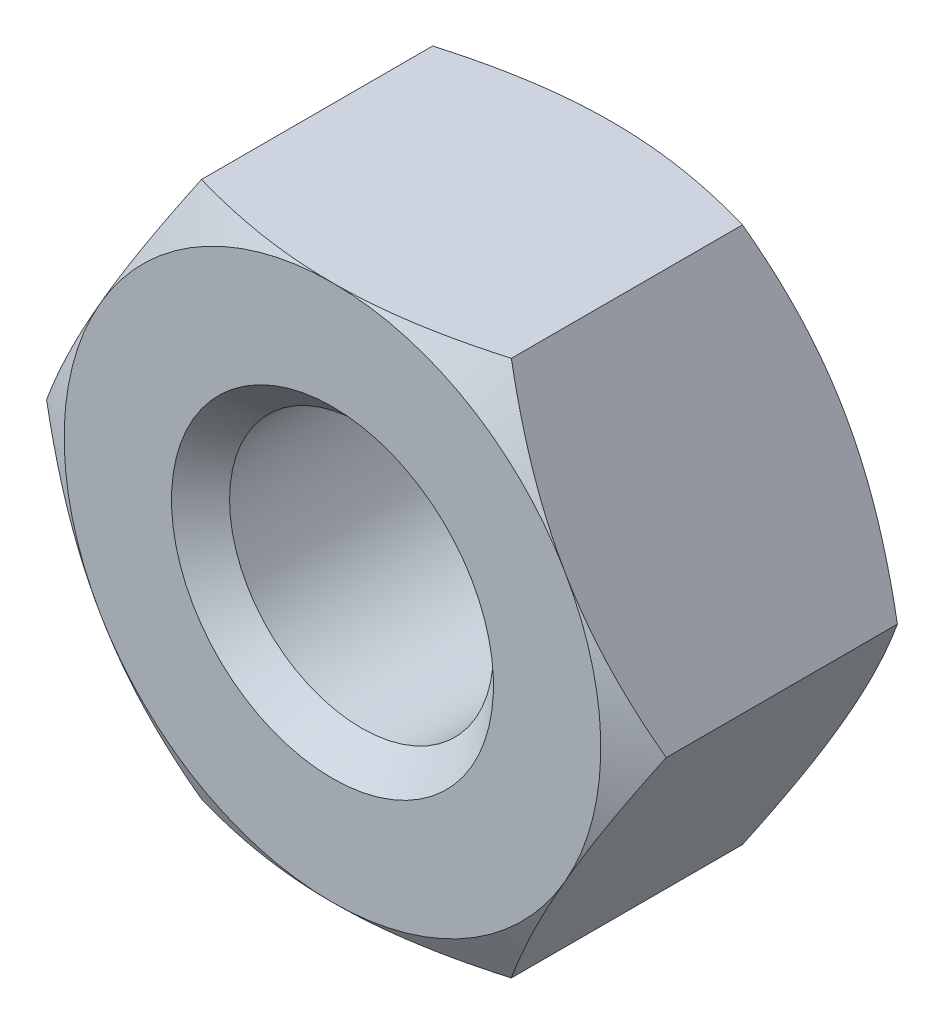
ISO-10303-21;
HEADER;
FILE_DESCRIPTION(('STEP AP214'),'2;1');
FILE_NAME('part.step','',(''),(''),'','','');
FILE_SCHEMA(('AUTOMOTIVE_DESIGN { 1 0 10303 214 1 1 1 1 }'));
ENDSEC;
DATA;
#1=APPLICATION_CONTEXT('core data for automotive mechanical design processes');
#2=APPLICATION_PROTOCOL_DEFINITION('international standard','automotive_design',2000,#1);
#3=PRODUCT_CONTEXT('',#1,'mechanical');
#4=PRODUCT('Part','Part','',(#3));
#5=PRODUCT_RELATED_PRODUCT_CATEGORY('part','',(#4));
#6=PRODUCT_DEFINITION_FORMATION('','',#4);
#7=PRODUCT_DEFINITION_CONTEXT('part definition',#1,'design');
#8=PRODUCT_DEFINITION('design','',#6,#7);
#9=PRODUCT_DEFINITION_SHAPE('','',#8);
#10=(LENGTH_UNIT() NAMED_UNIT(*) SI_UNIT(.MILLI.,.METRE.));
#11=(NAMED_UNIT(*) PLANE_ANGLE_UNIT() SI_UNIT($,.RADIAN.));
#12=(NAMED_UNIT(*) SI_UNIT($,.STERADIAN.) SOLID_ANGLE_UNIT());
#13=UNCERTAINTY_MEASURE_WITH_UNIT(LENGTH_MEASURE(1.E-05),#10,'distance_accuracy_value','');
#14=(GEOMETRIC_REPRESENTATION_CONTEXT(3) GLOBAL_UNCERTAINTY_ASSIGNED_CONTEXT((#13)) GLOBAL_UNIT_ASSIGNED_CONTEXT((#10,
#11,#12)) REPRESENTATION_CONTEXT('',''));
#15=CARTESIAN_POINT('',(0.,0.,0.));
#16=DIRECTION('',(0.,0.,1.));
#17=DIRECTION('',(1.,0.,0.));
#18=AXIS2_PLACEMENT_3D('',#15,#16,#17);
#19=CARTESIAN_POINT('',(4.3301270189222,2.5,-1.));
#20=DIRECTION('',(0.866025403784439,0.5,0.));
#21=DIRECTION('',(-0.5,0.866025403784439,0.));
#22=AXIS2_PLACEMENT_3D('',#19,#20,#21);
#23=PLANE('',#22);
#24=CARTESIAN_POINT('',(2.8852546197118,5.00259240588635,0.44744645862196));
#25=CARTESIAN_POINT('',(3.65965258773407,3.66129577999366,0.));
#26=CARTESIAN_POINT('',(4.3301270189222,2.5,0.));
#27=CARTESIAN_POINT('',(5.0006014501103,1.33870422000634,0.));
#28=CARTESIAN_POINT('',(5.77499941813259,-0.00259240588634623,0.447446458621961));
#29=(BOUNDED_CURVE() B_SPLINE_CURVE(2,(#24,#25,#26,#27,#28),.UNSPECIFIED.,.F.,
.F.) B_SPLINE_CURVE_WITH_KNOTS((3,2,3),(0.,2.9316581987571,5.8633163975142),
.UNSPECIFIED.) CURVE() GEOMETRIC_REPRESENTATION_ITEM() RATIONAL_B_SPLINE_CURVE((1.,
1.03802697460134,1.,1.03802697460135,1.)) REPRESENTATION_ITEM(''));
#30=CARTESIAN_POINT('',(2.88675134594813,5.,0.446581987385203));
#31=VERTEX_POINT('',#30);
#32=CARTESIAN_POINT('',(4.3301270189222,2.5,0.));
#33=VERTEX_POINT('',#32);
#34=EDGE_CURVE('E358',#31,#33,#29,.T.);
#35=ORIENTED_EDGE('',*,*,#34,.F.);
#36=DIRECTION('',(0.,0.,1.));
#37=VECTOR('',#36,1.);
#38=CARTESIAN_POINT('',(2.88675134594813,5.,-1.));
#39=LINE('',#38,#37);
#40=CARTESIAN_POINT('',(2.88675134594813,5.,4.7534180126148));
#41=VERTEX_POINT('',#40);
#42=EDGE_CURVE('E74',#31,#41,#39,.T.);
#43=ORIENTED_EDGE('',*,*,#42,.T.);
#44=CARTESIAN_POINT('',(5.77499941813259,-0.00259240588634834,4.75255354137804));
#45=CARTESIAN_POINT('',(5.00060145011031,1.33870422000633,5.19999999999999));
#46=CARTESIAN_POINT('',(4.3301270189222,2.5,5.2));
#47=CARTESIAN_POINT('',(3.65965258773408,3.66129577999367,5.2));
#48=CARTESIAN_POINT('',(2.88525461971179,5.00259240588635,4.75255354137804));
#49=(BOUNDED_CURVE() B_SPLINE_CURVE(2,(#44,#45,#46,#47,#48),.UNSPECIFIED.,.F.,
.F.) B_SPLINE_CURVE_WITH_KNOTS((3,2,3),(0.,2.9316581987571,5.86331639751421),
.UNSPECIFIED.) CURVE() GEOMETRIC_REPRESENTATION_ITEM() RATIONAL_B_SPLINE_CURVE((1.,
1.03802697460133,1.,1.03802697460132,1.)) REPRESENTATION_ITEM(''));
#50=CARTESIAN_POINT('',(4.3301270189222,2.5,5.2));
#51=VERTEX_POINT('',#50);
#52=EDGE_CURVE('E350',#51,#41,#49,.T.);
#53=ORIENTED_EDGE('',*,*,#52,.F.);
#54=CARTESIAN_POINT('',(5.77499941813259,-0.00259240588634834,4.75255354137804));
#55=CARTESIAN_POINT('',(5.00060145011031,1.33870422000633,5.19999999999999));
#56=CARTESIAN_POINT('',(4.3301270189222,2.5,5.2));
#57=CARTESIAN_POINT('',(3.65965258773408,3.66129577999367,5.2));
#58=CARTESIAN_POINT('',(2.88525461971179,5.00259240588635,4.75255354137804));
#59=(BOUNDED_CURVE() B_SPLINE_CURVE(2,(#54,#55,#56,#57,#58),.UNSPECIFIED.,.F.,
.F.) B_SPLINE_CURVE_WITH_KNOTS((3,2,3),(0.,2.9316581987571,5.86331639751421),
.UNSPECIFIED.) CURVE() GEOMETRIC_REPRESENTATION_ITEM() RATIONAL_B_SPLINE_CURVE((1.,
1.03802697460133,1.,1.03802697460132,1.)) REPRESENTATION_ITEM(''));
#60=CARTESIAN_POINT('',(5.77350269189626,0.,4.7534180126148));
#61=VERTEX_POINT('',#60);
#62=EDGE_CURVE('E530',#61,#51,#59,.T.);
#63=ORIENTED_EDGE('',*,*,#62,.F.);
#64=DIRECTION('',(0.,0.,1.));
#65=VECTOR('',#64,1.);
#66=CARTESIAN_POINT('',(5.77350269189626,0.,-1.));
#67=LINE('',#66,#65);
#68=CARTESIAN_POINT('',(5.77350269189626,0.,0.446581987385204));
#69=VERTEX_POINT('',#68);
#70=EDGE_CURVE('E420',#69,#61,#67,.T.);
#71=ORIENTED_EDGE('',*,*,#70,.F.);
#72=CARTESIAN_POINT('',(2.8852546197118,5.00259240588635,0.44744645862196));
#73=CARTESIAN_POINT('',(3.65965258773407,3.66129577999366,0.));
#74=CARTESIAN_POINT('',(4.3301270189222,2.5,0.));
#75=CARTESIAN_POINT('',(5.0006014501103,1.33870422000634,0.));
#76=CARTESIAN_POINT('',(5.77499941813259,-0.00259240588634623,0.447446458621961));
#77=(BOUNDED_CURVE() B_SPLINE_CURVE(2,(#72,#73,#74,#75,#76),.UNSPECIFIED.,.F.,
.F.) B_SPLINE_CURVE_WITH_KNOTS((3,2,3),(0.,2.9316581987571,5.8633163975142),
.UNSPECIFIED.) CURVE() GEOMETRIC_REPRESENTATION_ITEM() RATIONAL_B_SPLINE_CURVE((1.,
1.03802697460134,1.,1.03802697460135,1.)) REPRESENTATION_ITEM(''));
#78=EDGE_CURVE('E447',#33,#69,#77,.T.);
#79=ORIENTED_EDGE('',*,*,#78,.F.);
#80=EDGE_LOOP('',(#35,#43,#53,#63,#71,#79));
#81=FACE_BOUND('',#80,.T.);
#82=ADVANCED_FACE('F56',(#81),#23,.T.);
#83=CARTESIAN_POINT('',(0.,5.,-1.));
#84=DIRECTION('',(0.,1.,0.));
#85=DIRECTION('',(-1.,0.,0.));
#86=AXIS2_PLACEMENT_3D('',#83,#84,#85);
#87=PLANE('',#86);
#88=CARTESIAN_POINT('',(-2.88974479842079,5.,0.44744645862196));
#89=CARTESIAN_POINT('',(-1.34094886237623,5.,0.));
#90=CARTESIAN_POINT('',(0.,5.,0.));
#91=CARTESIAN_POINT('',(1.34094886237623,5.,0.));
#92=CARTESIAN_POINT('',(2.88974479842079,5.,0.44744645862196));
#93=(BOUNDED_CURVE() B_SPLINE_CURVE(2,(#88,#89,#90,#91,#92),.UNSPECIFIED.,.F.,
.F.) B_SPLINE_CURVE_WITH_KNOTS((3,2,3),(0.,2.9316581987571,5.8633163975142),
.UNSPECIFIED.) CURVE() GEOMETRIC_REPRESENTATION_ITEM() RATIONAL_B_SPLINE_CURVE((1.,
1.03802697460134,1.,1.03802697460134,1.)) REPRESENTATION_ITEM(''));
#94=CARTESIAN_POINT('',(-2.88675134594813,5.,0.446581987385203));
#95=VERTEX_POINT('',#94);
#96=CARTESIAN_POINT('',(0.,5.,0.));
#97=VERTEX_POINT('',#96);
#98=EDGE_CURVE('E258',#95,#97,#93,.T.);
#99=ORIENTED_EDGE('',*,*,#98,.F.);
#100=DIRECTION('',(0.,0.,1.));
#101=VECTOR('',#100,1.);
#102=CARTESIAN_POINT('',(-2.88675134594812,5.,-1.));
#103=LINE('',#102,#101);
#104=CARTESIAN_POINT('',(-2.88675134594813,5.,4.7534180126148));
#105=VERTEX_POINT('',#104);
#106=EDGE_CURVE('E193',#95,#105,#103,.T.);
#107=ORIENTED_EDGE('',*,*,#106,.T.);
#108=CARTESIAN_POINT('',(2.88974479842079,5.,4.75255354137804));
#109=CARTESIAN_POINT('',(1.34094886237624,5.,5.2));
#110=CARTESIAN_POINT('',(0.,5.,5.2));
#111=CARTESIAN_POINT('',(-1.34094886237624,5.,5.2));
#112=CARTESIAN_POINT('',(-2.88974479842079,5.,4.75255354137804));
#113=(BOUNDED_CURVE() B_SPLINE_CURVE(2,(#108,#109,#110,#111,#112),.UNSPECIFIED.,.F.,
.F.) B_SPLINE_CURVE_WITH_KNOTS((3,2,3),(0.,2.9316581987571,5.8633163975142),
.UNSPECIFIED.) CURVE() GEOMETRIC_REPRESENTATION_ITEM() RATIONAL_B_SPLINE_CURVE((1.,
1.03802697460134,1.,1.03802697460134,1.)) REPRESENTATION_ITEM(''));
#114=CARTESIAN_POINT('',(0.,5.,5.2));
#115=VERTEX_POINT('',#114);
#116=EDGE_CURVE('E475',#115,#105,#113,.T.);
#117=ORIENTED_EDGE('',*,*,#116,.F.);
#118=CARTESIAN_POINT('',(2.88974479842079,5.,4.75255354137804));
#119=CARTESIAN_POINT('',(1.34094886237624,5.,5.2));
#120=CARTESIAN_POINT('',(0.,5.,5.2));
#121=CARTESIAN_POINT('',(-1.34094886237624,5.,5.2));
#122=CARTESIAN_POINT('',(-2.88974479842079,5.,4.75255354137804));
#123=(BOUNDED_CURVE() B_SPLINE_CURVE(2,(#118,#119,#120,#121,#122),.UNSPECIFIED.,.F.,
.F.) B_SPLINE_CURVE_WITH_KNOTS((3,2,3),(0.,2.9316581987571,5.8633163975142),
.UNSPECIFIED.) CURVE() GEOMETRIC_REPRESENTATION_ITEM() RATIONAL_B_SPLINE_CURVE((1.,
1.03802697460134,1.,1.03802697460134,1.)) REPRESENTATION_ITEM(''));
#124=EDGE_CURVE('E299',#41,#115,#123,.T.);
#125=ORIENTED_EDGE('',*,*,#124,.F.);
#126=ORIENTED_EDGE('',*,*,#42,.F.);
#127=CARTESIAN_POINT('',(-2.88974479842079,5.,0.44744645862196));
#128=CARTESIAN_POINT('',(-1.34094886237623,5.,0.));
#129=CARTESIAN_POINT('',(0.,5.,0.));
#130=CARTESIAN_POINT('',(1.34094886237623,5.,0.));
#131=CARTESIAN_POINT('',(2.88974479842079,5.,0.44744645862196));
#132=(BOUNDED_CURVE() B_SPLINE_CURVE(2,(#127,#128,#129,#130,#131),.UNSPECIFIED.,.F.,
.F.) B_SPLINE_CURVE_WITH_KNOTS((3,2,3),(0.,2.9316581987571,5.8633163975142),
.UNSPECIFIED.) CURVE() GEOMETRIC_REPRESENTATION_ITEM() RATIONAL_B_SPLINE_CURVE((1.,
1.03802697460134,1.,1.03802697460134,1.)) REPRESENTATION_ITEM(''));
#133=EDGE_CURVE('E221',#97,#31,#132,.T.);
#134=ORIENTED_EDGE('',*,*,#133,.F.);
#135=EDGE_LOOP('',(#99,#107,#117,#125,#126,#134));
#136=FACE_BOUND('',#135,.T.);
#137=ADVANCED_FACE('F619',(#136),#87,.T.);
#138=CARTESIAN_POINT('',(-4.3301270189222,2.5,-1.));
#139=DIRECTION('',(-0.866025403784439,0.5,0.));
#140=DIRECTION('',(-0.5,-0.866025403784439,0.));
#141=AXIS2_PLACEMENT_3D('',#138,#139,#140);
#142=PLANE('',#141);
#143=CARTESIAN_POINT('',(-5.77499941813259,-0.00259240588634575,0.44744645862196));
#144=CARTESIAN_POINT('',(-5.00060145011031,1.33870422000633,0.));
#145=CARTESIAN_POINT('',(-4.33012701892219,2.5,0.));
#146=CARTESIAN_POINT('',(-3.65965258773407,3.66129577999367,0.));
#147=CARTESIAN_POINT('',(-2.88525461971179,5.00259240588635,0.44744645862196));
#148=(BOUNDED_CURVE() B_SPLINE_CURVE(2,(#143,#144,#145,#146,#147),.UNSPECIFIED.,.F.,
.F.) B_SPLINE_CURVE_WITH_KNOTS((3,2,3),(0.,2.9316581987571,5.86331639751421),
.UNSPECIFIED.) CURVE() GEOMETRIC_REPRESENTATION_ITEM() RATIONAL_B_SPLINE_CURVE((1.,
1.03802697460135,1.,1.03802697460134,1.)) REPRESENTATION_ITEM(''));
#149=CARTESIAN_POINT('',(-5.77350269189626,0.,0.446581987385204));
#150=VERTEX_POINT('',#149);
#151=CARTESIAN_POINT('',(-4.3301270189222,2.5,0.));
#152=VERTEX_POINT('',#151);
#153=EDGE_CURVE('E162',#150,#152,#148,.T.);
#154=ORIENTED_EDGE('',*,*,#153,.F.);
#155=DIRECTION('',(0.,0.,1.));
#156=VECTOR('',#155,1.);
#157=CARTESIAN_POINT('',(-5.77350269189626,0.,-1.));
#158=LINE('',#157,#156);
#159=CARTESIAN_POINT('',(-5.77350269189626,0.,4.7534180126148));
#160=VERTEX_POINT('',#159);
#161=EDGE_CURVE('E389',#150,#160,#158,.T.);
#162=ORIENTED_EDGE('',*,*,#161,.T.);
#163=CARTESIAN_POINT('',(-2.88525461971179,5.00259240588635,4.75255354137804));
#164=CARTESIAN_POINT('',(-3.65965258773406,3.66129577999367,5.19999999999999));
#165=CARTESIAN_POINT('',(-4.33012701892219,2.5,5.2));
#166=CARTESIAN_POINT('',(-5.00060145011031,1.33870422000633,5.2));
#167=CARTESIAN_POINT('',(-5.77499941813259,-0.00259240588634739,4.75255354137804));
#168=(BOUNDED_CURVE() B_SPLINE_CURVE(2,(#163,#164,#165,#166,#167),.UNSPECIFIED.,.F.,
.F.) B_SPLINE_CURVE_WITH_KNOTS((3,2,3),(0.,2.9316581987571,5.86331639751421),
.UNSPECIFIED.) CURVE() GEOMETRIC_REPRESENTATION_ITEM() RATIONAL_B_SPLINE_CURVE((1.,
1.03802697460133,1.,1.03802697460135,1.)) REPRESENTATION_ITEM(''));
#169=CARTESIAN_POINT('',(-4.3301270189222,2.5,5.2));
#170=VERTEX_POINT('',#169);
#171=EDGE_CURVE('E278',#170,#160,#168,.T.);
#172=ORIENTED_EDGE('',*,*,#171,.F.);
#173=CARTESIAN_POINT('',(-2.88525461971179,5.00259240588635,4.75255354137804));
#174=CARTESIAN_POINT('',(-3.65965258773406,3.66129577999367,5.19999999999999));
#175=CARTESIAN_POINT('',(-4.33012701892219,2.5,5.2));
#176=CARTESIAN_POINT('',(-5.00060145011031,1.33870422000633,5.2));
#177=CARTESIAN_POINT('',(-5.77499941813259,-0.00259240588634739,4.75255354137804));
#178=(BOUNDED_CURVE() B_SPLINE_CURVE(2,(#173,#174,#175,#176,#177),.UNSPECIFIED.,.F.,
.F.) B_SPLINE_CURVE_WITH_KNOTS((3,2,3),(0.,2.9316581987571,5.86331639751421),
.UNSPECIFIED.) CURVE() GEOMETRIC_REPRESENTATION_ITEM() RATIONAL_B_SPLINE_CURVE((1.,
1.03802697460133,1.,1.03802697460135,1.)) REPRESENTATION_ITEM(''));
#179=EDGE_CURVE('E259',#105,#170,#178,.T.);
#180=ORIENTED_EDGE('',*,*,#179,.F.);
#181=ORIENTED_EDGE('',*,*,#106,.F.);
#182=CARTESIAN_POINT('',(-5.77499941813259,-0.00259240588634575,0.44744645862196));
#183=CARTESIAN_POINT('',(-5.00060145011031,1.33870422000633,0.));
#184=CARTESIAN_POINT('',(-4.33012701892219,2.5,0.));
#185=CARTESIAN_POINT('',(-3.65965258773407,3.66129577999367,0.));
#186=CARTESIAN_POINT('',(-2.88525461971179,5.00259240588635,0.44744645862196));
#187=(BOUNDED_CURVE() B_SPLINE_CURVE(2,(#182,#183,#184,#185,#186),.UNSPECIFIED.,.F.,
.F.) B_SPLINE_CURVE_WITH_KNOTS((3,2,3),(0.,2.9316581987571,5.86331639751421),
.UNSPECIFIED.) CURVE() GEOMETRIC_REPRESENTATION_ITEM() RATIONAL_B_SPLINE_CURVE((1.,
1.03802697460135,1.,1.03802697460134,1.)) REPRESENTATION_ITEM(''));
#188=EDGE_CURVE('E322',#152,#95,#187,.T.);
#189=ORIENTED_EDGE('',*,*,#188,.F.);
#190=EDGE_LOOP('',(#154,#162,#172,#180,#181,#189));
#191=FACE_BOUND('',#190,.T.);
#192=ADVANCED_FACE('F614',(#191),#142,.T.);
#193=CARTESIAN_POINT('',(4.3301270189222,-2.5,-1.));
#194=DIRECTION('',(0.866025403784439,-0.5,0.));
#195=DIRECTION('',(0.5,0.866025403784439,0.));
#196=AXIS2_PLACEMENT_3D('',#193,#194,#195);
#197=PLANE('',#196);
#198=CARTESIAN_POINT('',(5.77499941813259,0.00259240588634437,0.447446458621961));
#199=CARTESIAN_POINT('',(5.00060145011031,-1.33870422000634,0.));
#200=CARTESIAN_POINT('',(4.3301270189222,-2.5,0.));
#201=CARTESIAN_POINT('',(3.65965258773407,-3.66129577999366,0.));
#202=CARTESIAN_POINT('',(2.8852546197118,-5.00259240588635,0.447446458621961));
#203=(BOUNDED_CURVE() B_SPLINE_CURVE(2,(#198,#199,#200,#201,#202),.UNSPECIFIED.,.F.,
.F.) B_SPLINE_CURVE_WITH_KNOTS((3,2,3),(0.,2.9316581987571,5.8633163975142),
.UNSPECIFIED.) CURVE() GEOMETRIC_REPRESENTATION_ITEM() RATIONAL_B_SPLINE_CURVE((1.,
1.03802697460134,1.,1.03802697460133,1.)) REPRESENTATION_ITEM(''));
#204=CARTESIAN_POINT('',(4.3301270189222,-2.5,0.));
#205=VERTEX_POINT('',#204);
#206=CARTESIAN_POINT('',(2.88675134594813,-5.,0.446581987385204));
#207=VERTEX_POINT('',#206);
#208=EDGE_CURVE('E182',#205,#207,#203,.T.);
#209=ORIENTED_EDGE('',*,*,#208,.F.);
#210=CARTESIAN_POINT('',(5.77499941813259,0.00259240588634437,0.447446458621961));
#211=CARTESIAN_POINT('',(5.00060145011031,-1.33870422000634,0.));
#212=CARTESIAN_POINT('',(4.3301270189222,-2.5,0.));
#213=CARTESIAN_POINT('',(3.65965258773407,-3.66129577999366,0.));
#214=CARTESIAN_POINT('',(2.8852546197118,-5.00259240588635,0.447446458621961));
#215=(BOUNDED_CURVE() B_SPLINE_CURVE(2,(#210,#211,#212,#213,#214),.UNSPECIFIED.,.F.,
.F.) B_SPLINE_CURVE_WITH_KNOTS((3,2,3),(0.,2.9316581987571,5.8633163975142),
.UNSPECIFIED.) CURVE() GEOMETRIC_REPRESENTATION_ITEM() RATIONAL_B_SPLINE_CURVE((1.,
1.03802697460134,1.,1.03802697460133,1.)) REPRESENTATION_ITEM(''));
#216=EDGE_CURVE('E317',#69,#205,#215,.T.);
#217=ORIENTED_EDGE('',*,*,#216,.F.);
#218=ORIENTED_EDGE('',*,*,#70,.T.);
#219=CARTESIAN_POINT('',(2.88525461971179,-5.00259240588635,4.75255354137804));
#220=CARTESIAN_POINT('',(3.65965258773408,-3.66129577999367,5.2));
#221=CARTESIAN_POINT('',(4.3301270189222,-2.5,5.2));
#222=CARTESIAN_POINT('',(5.00060145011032,-1.33870422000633,5.2));
#223=CARTESIAN_POINT('',(5.77499941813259,0.00259240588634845,4.75255354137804));
#224=(BOUNDED_CURVE() B_SPLINE_CURVE(2,(#219,#220,#221,#222,#223),.UNSPECIFIED.,.F.,
.F.) B_SPLINE_CURVE_WITH_KNOTS((3,2,3),(0.,2.9316581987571,5.86331639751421),
.UNSPECIFIED.) CURVE() GEOMETRIC_REPRESENTATION_ITEM() RATIONAL_B_SPLINE_CURVE((1.,
1.03802697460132,1.,1.03802697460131,1.)) REPRESENTATION_ITEM(''));
#225=CARTESIAN_POINT('',(4.3301270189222,-2.5,5.2));
#226=VERTEX_POINT('',#225);
#227=EDGE_CURVE('E316',#226,#61,#224,.T.);
#228=ORIENTED_EDGE('',*,*,#227,.F.);
#229=CARTESIAN_POINT('',(2.88525461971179,-5.00259240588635,4.75255354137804));
#230=CARTESIAN_POINT('',(3.65965258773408,-3.66129577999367,5.2));
#231=CARTESIAN_POINT('',(4.3301270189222,-2.5,5.2));
#232=CARTESIAN_POINT('',(5.00060145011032,-1.33870422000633,5.2));
#233=CARTESIAN_POINT('',(5.77499941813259,0.00259240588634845,4.75255354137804));
#234=(BOUNDED_CURVE() B_SPLINE_CURVE(2,(#229,#230,#231,#232,#233),.UNSPECIFIED.,.F.,
.F.) B_SPLINE_CURVE_WITH_KNOTS((3,2,3),(0.,2.9316581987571,5.86331639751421),
.UNSPECIFIED.) CURVE() GEOMETRIC_REPRESENTATION_ITEM() RATIONAL_B_SPLINE_CURVE((1.,
1.03802697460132,1.,1.03802697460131,1.)) REPRESENTATION_ITEM(''));
#235=CARTESIAN_POINT('',(2.88675134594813,-5.,4.7534180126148));
#236=VERTEX_POINT('',#235);
#237=EDGE_CURVE('E244',#236,#226,#234,.T.);
#238=ORIENTED_EDGE('',*,*,#237,.F.);
#239=DIRECTION('',(0.,0.,1.));
#240=VECTOR('',#239,1.);
#241=CARTESIAN_POINT('',(2.88675134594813,-5.,-1.));
#242=LINE('',#241,#240);
#243=EDGE_CURVE('E455',#207,#236,#242,.T.);
#244=ORIENTED_EDGE('',*,*,#243,.F.);
#245=EDGE_LOOP('',(#209,#217,#218,#228,#238,#244));
#246=FACE_BOUND('',#245,.T.);
#247=ADVANCED_FACE('F525',(#246),#197,.T.);
#248=CARTESIAN_POINT('',(0.,-5.,-1.));
#249=DIRECTION('',(0.,-1.,0.));
#250=DIRECTION('',(1.,0.,0.));
#251=AXIS2_PLACEMENT_3D('',#248,#249,#250);
#252=PLANE('',#251);
#253=CARTESIAN_POINT('',(2.88974479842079,-5.,0.44744645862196));
#254=CARTESIAN_POINT('',(1.34094886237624,-5.,0.));
#255=CARTESIAN_POINT('',(0.,-5.,0.));
#256=CARTESIAN_POINT('',(-1.34094886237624,-5.,0.));
#257=CARTESIAN_POINT('',(-2.88974479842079,-5.,0.44744645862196));
#258=(BOUNDED_CURVE() B_SPLINE_CURVE(2,(#253,#254,#255,#256,#257),.UNSPECIFIED.,.F.,
.F.) B_SPLINE_CURVE_WITH_KNOTS((3,2,3),(0.,2.9316581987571,5.8633163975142),
.UNSPECIFIED.) CURVE() GEOMETRIC_REPRESENTATION_ITEM() RATIONAL_B_SPLINE_CURVE((1.,
1.03802697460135,1.,1.03802697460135,1.)) REPRESENTATION_ITEM(''));
#259=CARTESIAN_POINT('',(0.,-5.,0.));
#260=VERTEX_POINT('',#259);
#261=CARTESIAN_POINT('',(-2.88675134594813,-5.,0.446581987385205));
#262=VERTEX_POINT('',#261);
#263=EDGE_CURVE('E154',#260,#262,#258,.T.);
#264=ORIENTED_EDGE('',*,*,#263,.F.);
#265=CARTESIAN_POINT('',(2.88974479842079,-5.,0.44744645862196));
#266=CARTESIAN_POINT('',(1.34094886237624,-5.,0.));
#267=CARTESIAN_POINT('',(0.,-5.,0.));
#268=CARTESIAN_POINT('',(-1.34094886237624,-5.,0.));
#269=CARTESIAN_POINT('',(-2.88974479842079,-5.,0.44744645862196));
#270=(BOUNDED_CURVE() B_SPLINE_CURVE(2,(#265,#266,#267,#268,#269),.UNSPECIFIED.,.F.,
.F.) B_SPLINE_CURVE_WITH_KNOTS((3,2,3),(0.,2.9316581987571,5.8633163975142),
.UNSPECIFIED.) CURVE() GEOMETRIC_REPRESENTATION_ITEM() RATIONAL_B_SPLINE_CURVE((1.,
1.03802697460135,1.,1.03802697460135,1.)) REPRESENTATION_ITEM(''));
#271=EDGE_CURVE('E158',#207,#260,#270,.T.);
#272=ORIENTED_EDGE('',*,*,#271,.F.);
#273=ORIENTED_EDGE('',*,*,#243,.T.);
#274=CARTESIAN_POINT('',(-2.88974479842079,-5.,4.75255354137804));
#275=CARTESIAN_POINT('',(-1.34094886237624,-5.,5.2));
#276=CARTESIAN_POINT('',(0.,-5.,5.2));
#277=CARTESIAN_POINT('',(1.34094886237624,-5.,5.2));
#278=CARTESIAN_POINT('',(2.88974479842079,-5.,4.75255354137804));
#279=(BOUNDED_CURVE() B_SPLINE_CURVE(2,(#274,#275,#276,#277,#278),.UNSPECIFIED.,.F.,
.F.) B_SPLINE_CURVE_WITH_KNOTS((3,2,3),(0.,2.9316581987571,5.86331639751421),
.UNSPECIFIED.) CURVE() GEOMETRIC_REPRESENTATION_ITEM() RATIONAL_B_SPLINE_CURVE((1.,
1.03802697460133,1.,1.03802697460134,1.)) REPRESENTATION_ITEM(''));
#280=CARTESIAN_POINT('',(0.,-5.,5.2));
#281=VERTEX_POINT('',#280);
#282=EDGE_CURVE('E432',#281,#236,#279,.T.);
#283=ORIENTED_EDGE('',*,*,#282,.F.);
#284=CARTESIAN_POINT('',(-2.88974479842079,-5.,4.75255354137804));
#285=CARTESIAN_POINT('',(-1.34094886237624,-5.,5.2));
#286=CARTESIAN_POINT('',(0.,-5.,5.2));
#287=CARTESIAN_POINT('',(1.34094886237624,-5.,5.2));
#288=CARTESIAN_POINT('',(2.88974479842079,-5.,4.75255354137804));
#289=(BOUNDED_CURVE() B_SPLINE_CURVE(2,(#284,#285,#286,#287,#288),.UNSPECIFIED.,.F.,
.F.) B_SPLINE_CURVE_WITH_KNOTS((3,2,3),(0.,2.9316581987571,5.86331639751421),
.UNSPECIFIED.) CURVE() GEOMETRIC_REPRESENTATION_ITEM() RATIONAL_B_SPLINE_CURVE((1.,
1.03802697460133,1.,1.03802697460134,1.)) REPRESENTATION_ITEM(''));
#290=CARTESIAN_POINT('',(-2.88675134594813,-5.,4.7534180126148));
#291=VERTEX_POINT('',#290);
#292=EDGE_CURVE('E404',#291,#281,#289,.T.);
#293=ORIENTED_EDGE('',*,*,#292,.F.);
#294=DIRECTION('',(0.,0.,1.));
#295=VECTOR('',#294,1.);
#296=CARTESIAN_POINT('',(-2.88675134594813,-5.,-1.));
#297=LINE('',#296,#295);
#298=EDGE_CURVE('E126',#262,#291,#297,.T.);
#299=ORIENTED_EDGE('',*,*,#298,.F.);
#300=EDGE_LOOP('',(#264,#272,#273,#283,#293,#299));
#301=FACE_BOUND('',#300,.T.);
#302=ADVANCED_FACE('F156',(#301),#252,.T.);
#303=CARTESIAN_POINT('',(-4.3301270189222,-2.5,-1.));
#304=DIRECTION('',(-0.866025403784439,-0.5,0.));
#305=DIRECTION('',(0.5,-0.866025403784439,0.));
#306=AXIS2_PLACEMENT_3D('',#303,#304,#305);
#307=PLANE('',#306);
#308=CARTESIAN_POINT('',(-2.8852546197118,-5.00259240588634,0.447446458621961));
#309=CARTESIAN_POINT('',(-3.65965258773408,-3.66129577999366,0.));
#310=CARTESIAN_POINT('',(-4.3301270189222,-2.5,0.));
#311=CARTESIAN_POINT('',(-5.00060145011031,-1.33870422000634,0.));
#312=CARTESIAN_POINT('',(-5.77499941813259,0.00259240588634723,0.44744645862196));
#313=(BOUNDED_CURVE() B_SPLINE_CURVE(2,(#308,#309,#310,#311,#312),.UNSPECIFIED.,.F.,
.F.) B_SPLINE_CURVE_WITH_KNOTS((3,2,3),(0.,2.9316581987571,5.8633163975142),
.UNSPECIFIED.) CURVE() GEOMETRIC_REPRESENTATION_ITEM() RATIONAL_B_SPLINE_CURVE((1.,
1.03802697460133,1.,1.03802697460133,1.)) REPRESENTATION_ITEM(''));
#314=CARTESIAN_POINT('',(-4.3301270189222,-2.5,0.));
#315=VERTEX_POINT('',#314);
#316=EDGE_CURVE('E141',#315,#150,#313,.T.);
#317=ORIENTED_EDGE('',*,*,#316,.F.);
#318=CARTESIAN_POINT('',(-2.8852546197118,-5.00259240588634,0.447446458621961));
#319=CARTESIAN_POINT('',(-3.65965258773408,-3.66129577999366,0.));
#320=CARTESIAN_POINT('',(-4.3301270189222,-2.5,0.));
#321=CARTESIAN_POINT('',(-5.00060145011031,-1.33870422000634,0.));
#322=CARTESIAN_POINT('',(-5.77499941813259,0.00259240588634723,0.44744645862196));
#323=(BOUNDED_CURVE() B_SPLINE_CURVE(2,(#318,#319,#320,#321,#322),.UNSPECIFIED.,.F.,
.F.) B_SPLINE_CURVE_WITH_KNOTS((3,2,3),(0.,2.9316581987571,5.8633163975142),
.UNSPECIFIED.) CURVE() GEOMETRIC_REPRESENTATION_ITEM() RATIONAL_B_SPLINE_CURVE((1.,
1.03802697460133,1.,1.03802697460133,1.)) REPRESENTATION_ITEM(''));
#324=EDGE_CURVE('E168',#262,#315,#323,.T.);
#325=ORIENTED_EDGE('',*,*,#324,.F.);
#326=ORIENTED_EDGE('',*,*,#298,.T.);
#327=CARTESIAN_POINT('',(-5.77499941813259,0.00259240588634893,4.75255354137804));
#328=CARTESIAN_POINT('',(-5.00060145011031,-1.33870422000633,5.2));
#329=CARTESIAN_POINT('',(-4.3301270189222,-2.5,5.2));
#330=CARTESIAN_POINT('',(-3.65965258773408,-3.66129577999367,5.2));
#331=CARTESIAN_POINT('',(-2.8852546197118,-5.00259240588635,4.75255354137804));
#332=(BOUNDED_CURVE() B_SPLINE_CURVE(2,(#327,#328,#329,#330,#331),.UNSPECIFIED.,.F.,
.F.) B_SPLINE_CURVE_WITH_KNOTS((3,2,3),(0.,2.9316581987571,5.8633163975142),
.UNSPECIFIED.) CURVE() GEOMETRIC_REPRESENTATION_ITEM() RATIONAL_B_SPLINE_CURVE((1.,
1.03802697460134,1.,1.03802697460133,1.)) REPRESENTATION_ITEM(''));
#333=CARTESIAN_POINT('',(-4.3301270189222,-2.5,5.2));
#334=VERTEX_POINT('',#333);
#335=EDGE_CURVE('E132',#334,#291,#332,.T.);
#336=ORIENTED_EDGE('',*,*,#335,.F.);
#337=CARTESIAN_POINT('',(-5.77499941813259,0.00259240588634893,4.75255354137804));
#338=CARTESIAN_POINT('',(-5.00060145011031,-1.33870422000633,5.2));
#339=CARTESIAN_POINT('',(-4.3301270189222,-2.5,5.2));
#340=CARTESIAN_POINT('',(-3.65965258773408,-3.66129577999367,5.2));
#341=CARTESIAN_POINT('',(-2.8852546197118,-5.00259240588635,4.75255354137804));
#342=(BOUNDED_CURVE() B_SPLINE_CURVE(2,(#337,#338,#339,#340,#341),.UNSPECIFIED.,.F.,
.F.) B_SPLINE_CURVE_WITH_KNOTS((3,2,3),(0.,2.9316581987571,5.8633163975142),
.UNSPECIFIED.) CURVE() GEOMETRIC_REPRESENTATION_ITEM() RATIONAL_B_SPLINE_CURVE((1.,
1.03802697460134,1.,1.03802697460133,1.)) REPRESENTATION_ITEM(''));
#343=EDGE_CURVE('E438',#160,#334,#342,.T.);
#344=ORIENTED_EDGE('',*,*,#343,.F.);
#345=ORIENTED_EDGE('',*,*,#161,.F.);
#346=EDGE_LOOP('',(#317,#325,#326,#336,#344,#345));
#347=FACE_BOUND('',#346,.T.);
#348=ADVANCED_FACE('F683',(#347),#307,.T.);
#349=CARTESIAN_POINT('',(4.,0.,0.));
#350=DIRECTION('',(0.,0.,-1.));
#351=DIRECTION('',(-1.,0.,0.));
#352=AXIS2_PLACEMENT_3D('',#349,#350,#351);
#353=PLANE('',#352);
#354=CARTESIAN_POINT('',(0.,0.,0.));
#355=DIRECTION('',(0.,0.,-1.));
#356=DIRECTION('',(0.,1.,0.));
#357=AXIS2_PLACEMENT_3D('',#354,#355,#356);
#358=CIRCLE('',#357,3.00000000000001);
#359=CARTESIAN_POINT('',(0.,3.00000000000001,0.));
#360=VERTEX_POINT('',#359);
#361=EDGE_CURVE('E12',#360,#360,#358,.F.);
#362=ORIENTED_EDGE('',*,*,#361,.T.);
#363=EDGE_LOOP('',(#362));
#364=FACE_BOUND('',#363,.T.);
#365=CARTESIAN_POINT('',(0.,0.,0.));
#366=DIRECTION('',(0.,0.,1.));
#367=DIRECTION('',(1.,0.,0.));
#368=AXIS2_PLACEMENT_3D('',#365,#366,#367);
#369=CIRCLE('',#368,5.);
#370=EDGE_CURVE('E177',#205,#33,#369,.T.);
#371=ORIENTED_EDGE('',*,*,#370,.F.);
#372=CARTESIAN_POINT('',(0.,0.,0.));
#373=DIRECTION('',(0.,0.,1.));
#374=DIRECTION('',(1.,0.,0.));
#375=AXIS2_PLACEMENT_3D('',#372,#373,#374);
#376=CIRCLE('',#375,5.);
#377=EDGE_CURVE('E174',#260,#205,#376,.T.);
#378=ORIENTED_EDGE('',*,*,#377,.F.);
#379=CARTESIAN_POINT('',(0.,0.,0.));
#380=DIRECTION('',(0.,0.,1.));
#381=DIRECTION('',(1.,0.,0.));
#382=AXIS2_PLACEMENT_3D('',#379,#380,#381);
#383=CIRCLE('',#382,5.);
#384=EDGE_CURVE('E163',#315,#260,#383,.T.);
#385=ORIENTED_EDGE('',*,*,#384,.F.);
#386=CARTESIAN_POINT('',(0.,0.,0.));
#387=DIRECTION('',(0.,0.,1.));
#388=DIRECTION('',(1.,0.,0.));
#389=AXIS2_PLACEMENT_3D('',#386,#387,#388);
#390=CIRCLE('',#389,5.);
#391=EDGE_CURVE('E243',#152,#315,#390,.T.);
#392=ORIENTED_EDGE('',*,*,#391,.F.);
#393=CARTESIAN_POINT('',(0.,0.,0.));
#394=DIRECTION('',(0.,0.,1.));
#395=DIRECTION('',(1.,0.,0.));
#396=AXIS2_PLACEMENT_3D('',#393,#394,#395);
#397=CIRCLE('',#396,5.);
#398=EDGE_CURVE('E249',#97,#152,#397,.T.);
#399=ORIENTED_EDGE('',*,*,#398,.F.);
#400=CARTESIAN_POINT('',(0.,0.,0.));
#401=DIRECTION('',(0.,0.,1.));
#402=DIRECTION('',(1.,0.,0.));
#403=AXIS2_PLACEMENT_3D('',#400,#401,#402);
#404=CIRCLE('',#403,5.);
#405=EDGE_CURVE('E369',#33,#97,#404,.T.);
#406=ORIENTED_EDGE('',*,*,#405,.F.);
#407=EDGE_LOOP('',(#371,#378,#385,#392,#399,#406));
#408=FACE_BOUND('',#407,.T.);
#409=ADVANCED_FACE('F175',(#364,#408),#353,.T.);
#410=CARTESIAN_POINT('',(4.,0.,5.2));
#411=DIRECTION('',(0.,0.,1.));
#412=DIRECTION('',(1.,0.,0.));
#413=AXIS2_PLACEMENT_3D('',#410,#411,#412);
#414=PLANE('',#413);
#415=CARTESIAN_POINT('',(0.,0.,5.2));
#416=DIRECTION('',(0.,0.,1.));
#417=DIRECTION('',(0.,-1.,0.));
#418=AXIS2_PLACEMENT_3D('',#415,#416,#417);
#419=CIRCLE('',#418,3.);
#420=CARTESIAN_POINT('',(0.,-3.,5.2));
#421=VERTEX_POINT('',#420);
#422=EDGE_CURVE('E491',#421,#421,#419,.F.);
#423=ORIENTED_EDGE('',*,*,#422,.T.);
#424=EDGE_LOOP('',(#423));
#425=FACE_BOUND('',#424,.T.);
#426=CARTESIAN_POINT('',(0.,0.,5.2));
#427=DIRECTION('',(0.,0.,1.));
#428=DIRECTION('',(1.,0.,0.));
#429=AXIS2_PLACEMENT_3D('',#426,#427,#428);
#430=CIRCLE('',#429,5.);
#431=EDGE_CURVE('E357',#226,#51,#430,.T.);
#432=ORIENTED_EDGE('',*,*,#431,.T.);
#433=CARTESIAN_POINT('',(0.,0.,5.2));
#434=DIRECTION('',(0.,0.,1.));
#435=DIRECTION('',(1.,0.,0.));
#436=AXIS2_PLACEMENT_3D('',#433,#434,#435);
#437=CIRCLE('',#436,5.);
#438=EDGE_CURVE('E295',#51,#115,#437,.T.);
#439=ORIENTED_EDGE('',*,*,#438,.T.);
#440=CARTESIAN_POINT('',(0.,0.,5.2));
#441=DIRECTION('',(0.,0.,1.));
#442=DIRECTION('',(1.,0.,0.));
#443=AXIS2_PLACEMENT_3D('',#440,#441,#442);
#444=CIRCLE('',#443,5.);
#445=EDGE_CURVE('E370',#115,#170,#444,.T.);
#446=ORIENTED_EDGE('',*,*,#445,.T.);
#447=CARTESIAN_POINT('',(0.,0.,5.2));
#448=DIRECTION('',(0.,0.,1.));
#449=DIRECTION('',(1.,0.,0.));
#450=AXIS2_PLACEMENT_3D('',#447,#448,#449);
#451=CIRCLE('',#450,5.);
#452=EDGE_CURVE('E461',#170,#334,#451,.T.);
#453=ORIENTED_EDGE('',*,*,#452,.T.);
#454=CARTESIAN_POINT('',(0.,0.,5.2));
#455=DIRECTION('',(0.,0.,1.));
#456=DIRECTION('',(1.,0.,0.));
#457=AXIS2_PLACEMENT_3D('',#454,#455,#456);
#458=CIRCLE('',#457,5.);
#459=EDGE_CURVE('E419',#334,#281,#458,.T.);
#460=ORIENTED_EDGE('',*,*,#459,.T.);
#461=CARTESIAN_POINT('',(0.,0.,5.2));
#462=DIRECTION('',(0.,0.,1.));
#463=DIRECTION('',(1.,0.,0.));
#464=AXIS2_PLACEMENT_3D('',#461,#462,#463);
#465=CIRCLE('',#464,5.);
#466=EDGE_CURVE('E311',#281,#226,#465,.T.);
#467=ORIENTED_EDGE('',*,*,#466,.T.);
#468=EDGE_LOOP('',(#432,#439,#446,#453,#460,#467));
#469=FACE_BOUND('',#468,.T.);
#470=ADVANCED_FACE('F626',(#425,#469),#414,.T.);
#471=CARTESIAN_POINT('',(0.,0.,4.97627677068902));
#472=DIRECTION('',(0.,0.,-1.));
#473=DIRECTION('',(1.,0.,0.));
#474=AXIS2_PLACEMENT_3D('',#471,#472,#473);
#475=CONICAL_SURFACE('',#474,5.3875,1.0471975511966);
#476=ORIENTED_EDGE('',*,*,#52,.T.);
#477=ORIENTED_EDGE('',*,*,#124,.T.);
#478=ORIENTED_EDGE('',*,*,#438,.F.);
#479=EDGE_LOOP('',(#476,#477,#478));
#480=FACE_BOUND('',#479,.T.);
#481=ADVANCED_FACE('F678',(#480),#475,.T.);
#482=CARTESIAN_POINT('',(0.,0.,4.97627677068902));
#483=DIRECTION('',(0.,0.,-1.));
#484=DIRECTION('',(1.,0.,0.));
#485=AXIS2_PLACEMENT_3D('',#482,#483,#484);
#486=CONICAL_SURFACE('',#485,5.3875,1.0471975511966);
#487=ORIENTED_EDGE('',*,*,#227,.T.);
#488=ORIENTED_EDGE('',*,*,#62,.T.);
#489=ORIENTED_EDGE('',*,*,#431,.F.);
#490=EDGE_LOOP('',(#487,#488,#489));
#491=FACE_BOUND('',#490,.T.);
#492=ADVANCED_FACE('F534',(#491),#486,.T.);
#493=CARTESIAN_POINT('',(0.,0.,4.97627677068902));
#494=DIRECTION('',(0.,0.,-1.));
#495=DIRECTION('',(1.,0.,0.));
#496=AXIS2_PLACEMENT_3D('',#493,#494,#495);
#497=CONICAL_SURFACE('',#496,5.3875,1.0471975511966);
#498=ORIENTED_EDGE('',*,*,#282,.T.);
#499=ORIENTED_EDGE('',*,*,#237,.T.);
#500=ORIENTED_EDGE('',*,*,#466,.F.);
#501=EDGE_LOOP('',(#498,#499,#500));
#502=FACE_BOUND('',#501,.T.);
#503=ADVANCED_FACE('F631',(#502),#497,.T.);
#504=CARTESIAN_POINT('',(0.,0.,4.97627677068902));
#505=DIRECTION('',(0.,0.,-1.));
#506=DIRECTION('',(1.,0.,0.));
#507=AXIS2_PLACEMENT_3D('',#504,#505,#506);
#508=CONICAL_SURFACE('',#507,5.3875,1.0471975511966);
#509=ORIENTED_EDGE('',*,*,#292,.T.);
#510=ORIENTED_EDGE('',*,*,#459,.F.);
#511=ORIENTED_EDGE('',*,*,#335,.T.);
#512=EDGE_LOOP('',(#509,#510,#511));
#513=FACE_BOUND('',#512,.T.);
#514=ADVANCED_FACE('F628',(#513),#508,.T.);
#515=CARTESIAN_POINT('',(0.,0.,4.97627677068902));
#516=DIRECTION('',(0.,0.,-1.));
#517=DIRECTION('',(1.,0.,0.));
#518=AXIS2_PLACEMENT_3D('',#515,#516,#517);
#519=CONICAL_SURFACE('',#518,5.3875,1.0471975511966);
#520=ORIENTED_EDGE('',*,*,#343,.T.);
#521=ORIENTED_EDGE('',*,*,#452,.F.);
#522=ORIENTED_EDGE('',*,*,#171,.T.);
#523=EDGE_LOOP('',(#520,#521,#522));
#524=FACE_BOUND('',#523,.T.);
#525=ADVANCED_FACE('F630',(#524),#519,.T.);
#526=CARTESIAN_POINT('',(0.,0.,4.97627677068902));
#527=DIRECTION('',(0.,0.,-1.));
#528=DIRECTION('',(1.,0.,0.));
#529=AXIS2_PLACEMENT_3D('',#526,#527,#528);
#530=CONICAL_SURFACE('',#529,5.3875,1.0471975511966);
#531=ORIENTED_EDGE('',*,*,#179,.T.);
#532=ORIENTED_EDGE('',*,*,#445,.F.);
#533=ORIENTED_EDGE('',*,*,#116,.T.);
#534=EDGE_LOOP('',(#531,#532,#533));
#535=FACE_BOUND('',#534,.T.);
#536=ADVANCED_FACE('F637',(#535),#530,.T.);
#537=CARTESIAN_POINT('',(0.,0.,0.22372322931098));
#538=DIRECTION('',(0.,0.,1.));
#539=DIRECTION('',(1.,0.,0.));
#540=AXIS2_PLACEMENT_3D('',#537,#538,#539);
#541=CONICAL_SURFACE('',#540,5.3875,1.0471975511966);
#542=ORIENTED_EDGE('',*,*,#78,.T.);
#543=ORIENTED_EDGE('',*,*,#216,.T.);
#544=ORIENTED_EDGE('',*,*,#370,.T.);
#545=EDGE_LOOP('',(#542,#543,#544));
#546=FACE_BOUND('',#545,.T.);
#547=ADVANCED_FACE('F623',(#546),#541,.T.);
#548=CARTESIAN_POINT('',(0.,0.,0.22372322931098));
#549=DIRECTION('',(0.,0.,1.));
#550=DIRECTION('',(1.,0.,0.));
#551=AXIS2_PLACEMENT_3D('',#548,#549,#550);
#552=CONICAL_SURFACE('',#551,5.3875,1.0471975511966);
#553=ORIENTED_EDGE('',*,*,#133,.T.);
#554=ORIENTED_EDGE('',*,*,#34,.T.);
#555=ORIENTED_EDGE('',*,*,#405,.T.);
#556=EDGE_LOOP('',(#553,#554,#555));
#557=FACE_BOUND('',#556,.T.);
#558=ADVANCED_FACE('F621',(#557),#552,.T.);
#559=CARTESIAN_POINT('',(0.,0.,0.22372322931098));
#560=DIRECTION('',(0.,0.,1.));
#561=DIRECTION('',(1.,0.,0.));
#562=AXIS2_PLACEMENT_3D('',#559,#560,#561);
#563=CONICAL_SURFACE('',#562,5.3875,1.0471975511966);
#564=ORIENTED_EDGE('',*,*,#188,.T.);
#565=ORIENTED_EDGE('',*,*,#98,.T.);
#566=ORIENTED_EDGE('',*,*,#398,.T.);
#567=EDGE_LOOP('',(#564,#565,#566));
#568=FACE_BOUND('',#567,.T.);
#569=ADVANCED_FACE('F617',(#568),#563,.T.);
#570=CARTESIAN_POINT('',(0.,0.,0.22372322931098));
#571=DIRECTION('',(0.,0.,1.));
#572=DIRECTION('',(1.,0.,0.));
#573=AXIS2_PLACEMENT_3D('',#570,#571,#572);
#574=CONICAL_SURFACE('',#573,5.3875,1.0471975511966);
#575=ORIENTED_EDGE('',*,*,#153,.T.);
#576=ORIENTED_EDGE('',*,*,#391,.T.);
#577=ORIENTED_EDGE('',*,*,#316,.T.);
#578=EDGE_LOOP('',(#575,#576,#577));
#579=FACE_BOUND('',#578,.T.);
#580=ADVANCED_FACE('F611',(#579),#574,.T.);
#581=CARTESIAN_POINT('',(0.,0.,0.22372322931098));
#582=DIRECTION('',(0.,0.,1.));
#583=DIRECTION('',(1.,0.,0.));
#584=AXIS2_PLACEMENT_3D('',#581,#582,#583);
#585=CONICAL_SURFACE('',#584,5.3875,1.0471975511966);
#586=ORIENTED_EDGE('',*,*,#324,.T.);
#587=ORIENTED_EDGE('',*,*,#384,.T.);
#588=ORIENTED_EDGE('',*,*,#263,.T.);
#589=EDGE_LOOP('',(#586,#587,#588));
#590=FACE_BOUND('',#589,.T.);
#591=ADVANCED_FACE('F167',(#590),#585,.T.);
#592=CARTESIAN_POINT('',(0.,0.,0.22372322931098));
#593=DIRECTION('',(0.,0.,1.));
#594=DIRECTION('',(1.,0.,0.));
#595=AXIS2_PLACEMENT_3D('',#592,#593,#594);
#596=CONICAL_SURFACE('',#595,5.3875,1.0471975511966);
#597=ORIENTED_EDGE('',*,*,#271,.T.);
#598=ORIENTED_EDGE('',*,*,#377,.T.);
#599=ORIENTED_EDGE('',*,*,#208,.T.);
#600=EDGE_LOOP('',(#597,#598,#599));
#601=FACE_BOUND('',#600,.T.);
#602=ADVANCED_FACE('F183',(#601),#596,.T.);
#603=CARTESIAN_POINT('',(0.,0.,0.));
#604=DIRECTION('',(0.,0.,-1.));
#605=DIRECTION('',(0.,1.,0.));
#606=AXIS2_PLACEMENT_3D('',#603,#604,#605);
#607=CYLINDRICAL_SURFACE('',#606,2.45875000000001);
#608=CARTESIAN_POINT('',(0.,0.,4.65875000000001));
#609=DIRECTION('',(0.,0.,1.));
#610=DIRECTION('',(0.,-1.,0.));
#611=AXIS2_PLACEMENT_3D('',#608,#609,#610);
#612=CIRCLE('',#611,2.45875000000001);
#613=CARTESIAN_POINT('',(0.,-2.45875000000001,4.65875000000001));
#614=VERTEX_POINT('',#613);
#615=EDGE_CURVE('E67',#614,#614,#612,.T.);
#616=ORIENTED_EDGE('',*,*,#615,.T.);
#617=EDGE_LOOP('',(#616));
#618=FACE_BOUND('',#617,.T.);
#619=CARTESIAN_POINT('',(0.,0.,0.541249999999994));
#620=DIRECTION('',(0.,0.,-1.));
#621=DIRECTION('',(0.,1.,0.));
#622=AXIS2_PLACEMENT_3D('',#619,#620,#621);
#623=CIRCLE('',#622,2.45875000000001);
#624=CARTESIAN_POINT('',(0.,2.45875000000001,0.541249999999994));
#625=VERTEX_POINT('',#624);
#626=EDGE_CURVE('E515',#625,#625,#623,.T.);
#627=ORIENTED_EDGE('',*,*,#626,.T.);
#628=EDGE_LOOP('',(#627));
#629=FACE_BOUND('',#628,.T.);
#630=ADVANCED_FACE('F661',(#618,#629),#607,.F.);
#631=CARTESIAN_POINT('',(0.,0.,5.2));
#632=DIRECTION('',(0.,0.,1.));
#633=DIRECTION('',(0.,-1.,0.));
#634=AXIS2_PLACEMENT_3D('',#631,#632,#633);
#635=CONICAL_SURFACE('',#634,3.,0.785398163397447);
#636=ORIENTED_EDGE('',*,*,#615,.F.);
#637=EDGE_LOOP('',(#636));
#638=FACE_BOUND('',#637,.T.);
#639=ORIENTED_EDGE('',*,*,#422,.F.);
#640=EDGE_LOOP('',(#639));
#641=FACE_BOUND('',#640,.T.);
#642=ADVANCED_FACE('F657',(#638,#641),#635,.F.);
#643=CARTESIAN_POINT('',(0.,0.,0.541249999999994));
#644=DIRECTION('',(0.,0.,-1.));
#645=DIRECTION('',(0.,1.,0.));
#646=AXIS2_PLACEMENT_3D('',#643,#644,#645);
#647=CONICAL_SURFACE('',#646,2.45875000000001,0.785398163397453);
#648=ORIENTED_EDGE('',*,*,#361,.F.);
#649=EDGE_LOOP('',(#648));
#650=FACE_BOUND('',#649,.T.);
#651=ORIENTED_EDGE('',*,*,#626,.F.);
#652=EDGE_LOOP('',(#651));
#653=FACE_BOUND('',#652,.T.);
#654=ADVANCED_FACE('F59',(#650,#653),#647,.F.);
#655=CLOSED_SHELL('',(#82,#137,#192,#247,#302,#348,#409,#470,#481,#492,#503,#514,#525,#536,#547,
#558,#569,#580,#591,#602,#630,#642,#654));
#656=MANIFOLD_SOLID_BREP('B2',#655);
#657=ADVANCED_BREP_SHAPE_REPRESENTATION('',(#18,#656),#14);
#658=SHAPE_DEFINITION_REPRESENTATION(#9,#657);
ENDSEC;
END-ISO-10303-21;
